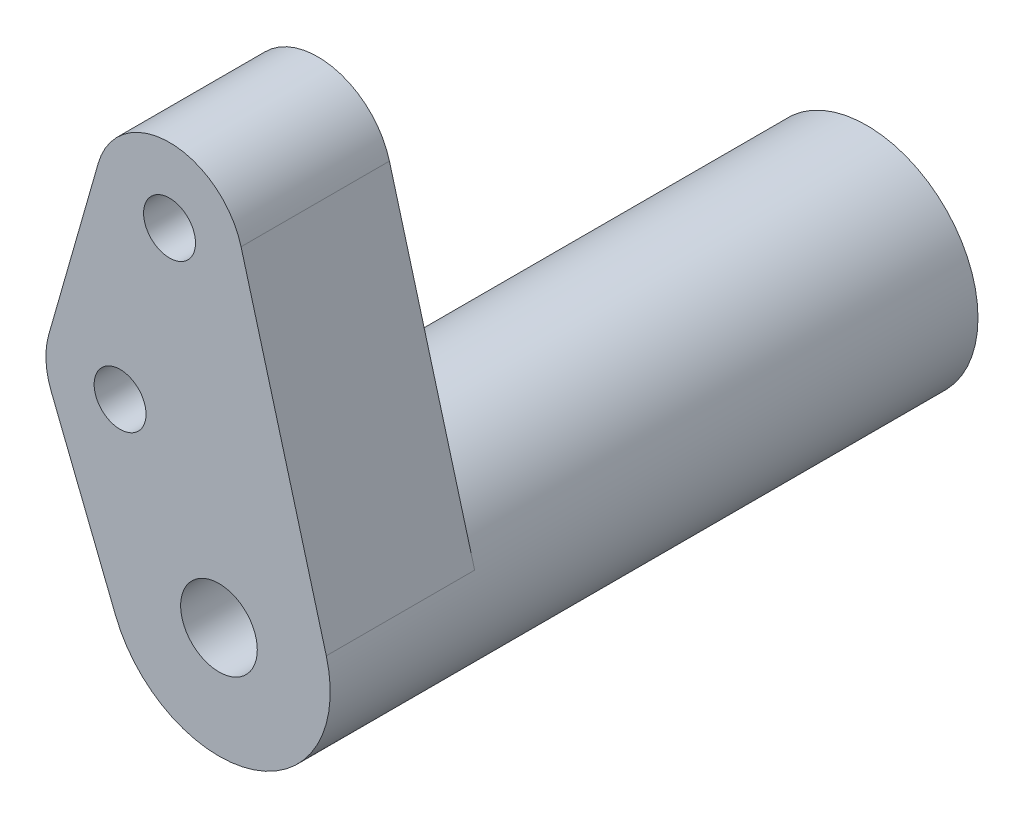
ISO-10303-21;
HEADER;
FILE_DESCRIPTION(('STEP AP214'),'2;1');
FILE_NAME('part.step','',(''),(''),'','','');
FILE_SCHEMA(('AUTOMOTIVE_DESIGN { 1 0 10303 214 1 1 1 1 }'));
ENDSEC;
DATA;
#1=APPLICATION_CONTEXT('core data for automotive mechanical design processes');
#2=APPLICATION_PROTOCOL_DEFINITION('international standard','automotive_design',2000,#1);
#3=PRODUCT_CONTEXT('',#1,'mechanical');
#4=PRODUCT('Part','Part','',(#3));
#5=PRODUCT_RELATED_PRODUCT_CATEGORY('part','',(#4));
#6=PRODUCT_DEFINITION_FORMATION('','',#4);
#7=PRODUCT_DEFINITION_CONTEXT('part definition',#1,'design');
#8=PRODUCT_DEFINITION('design','',#6,#7);
#9=PRODUCT_DEFINITION_SHAPE('','',#8);
#10=(LENGTH_UNIT() NAMED_UNIT(*) SI_UNIT(.MILLI.,.METRE.));
#11=(NAMED_UNIT(*) PLANE_ANGLE_UNIT() SI_UNIT($,.RADIAN.));
#12=(NAMED_UNIT(*) SI_UNIT($,.STERADIAN.) SOLID_ANGLE_UNIT());
#13=UNCERTAINTY_MEASURE_WITH_UNIT(LENGTH_MEASURE(1.E-05),#10,'distance_accuracy_value','');
#14=(GEOMETRIC_REPRESENTATION_CONTEXT(3) GLOBAL_UNCERTAINTY_ASSIGNED_CONTEXT((#13)) GLOBAL_UNIT_ASSIGNED_CONTEXT((#10,
#11,#12)) REPRESENTATION_CONTEXT('',''));
#15=CARTESIAN_POINT('',(0.,0.,0.));
#16=DIRECTION('',(0.,0.,1.));
#17=DIRECTION('',(1.,0.,0.));
#18=AXIS2_PLACEMENT_3D('',#15,#16,#17);
#19=CARTESIAN_POINT('',(-36.,-62.,14.));
#20=DIRECTION('',(0.,0.,1.));
#21=DIRECTION('',(1.,0.,0.));
#22=AXIS2_PLACEMENT_3D('',#19,#20,#21);
#23=PLANE('',#22);
#24=CARTESIAN_POINT('',(-36.,-62.,14.));
#25=DIRECTION('',(0.,0.,1.));
#26=DIRECTION('',(1.,0.,0.));
#27=AXIS2_PLACEMENT_3D('',#24,#25,#26);
#28=CIRCLE('',#27,9.);
#29=CARTESIAN_POINT('',(-27.,-62.,14.));
#30=VERTEX_POINT('',#29);
#31=EDGE_CURVE('E40',#30,#30,#28,.T.);
#32=ORIENTED_EDGE('',*,*,#31,.F.);
#33=EDGE_LOOP('',(#32));
#34=FACE_BOUND('',#33,.T.);
#35=CARTESIAN_POINT('',(-36.,-62.,14.));
#36=DIRECTION('',(0.,0.,1.));
#37=DIRECTION('',(1.,0.,0.));
#38=AXIS2_PLACEMENT_3D('',#35,#36,#37);
#39=CIRCLE('',#38,3.1);
#40=CARTESIAN_POINT('',(-32.9,-62.,14.));
#41=VERTEX_POINT('',#40);
#42=EDGE_CURVE('E142',#41,#41,#39,.T.);
#43=ORIENTED_EDGE('',*,*,#42,.T.);
#44=EDGE_LOOP('',(#43));
#45=FACE_BOUND('',#44,.T.);
#46=ADVANCED_FACE('F36',(#34,#45),#23,.F.);
#47=CARTESIAN_POINT('',(-36.,-62.,54.4));
#48=DIRECTION('',(0.,0.,-1.));
#49=DIRECTION('',(-1.,0.,0.));
#50=AXIS2_PLACEMENT_3D('',#47,#48,#49);
#51=CYLINDRICAL_SURFACE('',#50,9.);
#52=CARTESIAN_POINT('',(-36.,-62.,54.4));
#53=DIRECTION('',(0.,0.,1.));
#54=DIRECTION('',(1.,0.,0.));
#55=AXIS2_PLACEMENT_3D('',#52,#53,#54);
#56=CIRCLE('',#55,9.);
#57=CARTESIAN_POINT('',(-27.3187588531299,-59.6259629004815,54.4));
#58=VERTEX_POINT('',#57);
#59=CARTESIAN_POINT('',(-44.3631129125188,-65.3254086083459,54.4));
#60=VERTEX_POINT('',#59);
#61=EDGE_CURVE('E11',#58,#60,#56,.T.);
#62=ORIENTED_EDGE('',*,*,#61,.F.);
#63=DIRECTION('',(0.,0.,-1.));
#64=VECTOR('',#63,1.);
#65=CARTESIAN_POINT('',(-27.3187588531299,-59.6259629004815,66.4));
#66=LINE('',#65,#64);
#67=CARTESIAN_POINT('',(-27.3187588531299,-59.6259629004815,66.4));
#68=VERTEX_POINT('',#67);
#69=EDGE_CURVE('E114',#68,#58,#66,.T.);
#70=ORIENTED_EDGE('',*,*,#69,.F.);
#71=CARTESIAN_POINT('',(-36.,-62.,66.4));
#72=DIRECTION('',(0.,0.,1.));
#73=DIRECTION('',(1.,0.,0.));
#74=AXIS2_PLACEMENT_3D('',#71,#72,#73);
#75=CIRCLE('',#74,9.);
#76=CARTESIAN_POINT('',(-44.3631129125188,-65.3254086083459,66.4));
#77=VERTEX_POINT('',#76);
#78=EDGE_CURVE('E103',#77,#68,#75,.T.);
#79=ORIENTED_EDGE('',*,*,#78,.F.);
#80=DIRECTION('',(0.,0.,-1.));
#81=VECTOR('',#80,1.);
#82=CARTESIAN_POINT('',(-44.3631129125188,-65.3254086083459,66.4));
#83=LINE('',#82,#81);
#84=EDGE_CURVE('E137',#77,#60,#83,.T.);
#85=ORIENTED_EDGE('',*,*,#84,.T.);
#86=EDGE_LOOP('',(#62,#70,#79,#85));
#87=FACE_BOUND('',#86,.T.);
#88=ORIENTED_EDGE('',*,*,#31,.T.);
#89=EDGE_LOOP('',(#88));
#90=FACE_BOUND('',#89,.T.);
#91=ADVANCED_FACE('F38',(#87,#90),#51,.T.);
#92=CARTESIAN_POINT('',(-36.,-62.,54.4));
#93=DIRECTION('',(0.,0.,-1.));
#94=DIRECTION('',(-1.,0.,0.));
#95=AXIS2_PLACEMENT_3D('',#92,#93,#94);
#96=CYLINDRICAL_SURFACE('',#95,3.1);
#97=ORIENTED_EDGE('',*,*,#42,.F.);
#98=EDGE_LOOP('',(#97));
#99=FACE_BOUND('',#98,.T.);
#100=CARTESIAN_POINT('',(-36.,-62.,66.4));
#101=DIRECTION('',(0.,0.,1.));
#102=DIRECTION('',(1.,0.,0.));
#103=AXIS2_PLACEMENT_3D('',#100,#101,#102);
#104=CIRCLE('',#103,3.1);
#105=CARTESIAN_POINT('',(-32.9,-62.,66.4));
#106=VERTEX_POINT('',#105);
#107=EDGE_CURVE('E197',#106,#106,#104,.T.);
#108=ORIENTED_EDGE('',*,*,#107,.T.);
#109=EDGE_LOOP('',(#108));
#110=FACE_BOUND('',#109,.T.);
#111=ADVANCED_FACE('F154',(#99,#110),#96,.F.);
#112=CARTESIAN_POINT('',(-44.,-50.,54.4));
#113=DIRECTION('',(0.,0.,1.));
#114=DIRECTION('',(1.,0.,0.));
#115=AXIS2_PLACEMENT_3D('',#112,#113,#114);
#116=PLANE('',#115);
#117=CARTESIAN_POINT('',(-44.,-50.,54.4));
#118=DIRECTION('',(0.,0.,1.));
#119=DIRECTION('',(1.,0.,0.));
#120=AXIS2_PLACEMENT_3D('',#117,#118,#119);
#121=CIRCLE('',#120,2.09999999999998);
#122=CARTESIAN_POINT('',(-41.9,-50.,54.4));
#123=VERTEX_POINT('',#122);
#124=EDGE_CURVE('E196',#123,#123,#121,.T.);
#125=ORIENTED_EDGE('',*,*,#124,.T.);
#126=EDGE_LOOP('',(#125));
#127=FACE_BOUND('',#126,.T.);
#128=CARTESIAN_POINT('',(-40.,-36.,54.4));
#129=DIRECTION('',(0.,0.,1.));
#130=DIRECTION('',(1.,0.,0.));
#131=AXIS2_PLACEMENT_3D('',#128,#129,#130);
#132=CIRCLE('',#131,2.1);
#133=CARTESIAN_POINT('',(-37.9,-36.,54.4));
#134=VERTEX_POINT('',#133);
#135=EDGE_CURVE('E199',#134,#134,#132,.T.);
#136=ORIENTED_EDGE('',*,*,#135,.T.);
#137=EDGE_LOOP('',(#136));
#138=FACE_BOUND('',#137,.T.);
#139=DIRECTION('',(-0.263781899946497,0.96458234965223,0.));
#140=VECTOR('',#139,1.);
#141=CARTESIAN_POINT('',(-27.3187588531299,-59.6259629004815,54.4));
#142=LINE('',#141,#140);
#143=CARTESIAN_POINT('',(-34.2125059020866,-34.417308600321,54.4));
#144=VERTEX_POINT('',#143);
#145=EDGE_CURVE('E111',#58,#144,#142,.T.);
#146=ORIENTED_EDGE('',*,*,#145,.F.);
#147=ORIENTED_EDGE('',*,*,#61,.T.);
#148=DIRECTION('',(0.369489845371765,-0.929234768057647,0.));
#149=VECTOR('',#148,1.);
#150=CARTESIAN_POINT('',(-49.5754086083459,-52.2169390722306,54.4));
#151=LINE('',#150,#149);
#152=CARTESIAN_POINT('',(-49.5754086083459,-52.2169390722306,54.4));
#153=VERTEX_POINT('',#152);
#154=EDGE_CURVE('E126',#153,#60,#151,.T.);
#155=ORIENTED_EDGE('',*,*,#154,.F.);
#156=CARTESIAN_POINT('',(-44.,-50.,54.4));
#157=DIRECTION('',(0.,0.,1.));
#158=DIRECTION('',(1.,0.,0.));
#159=AXIS2_PLACEMENT_3D('',#156,#157,#158);
#160=CIRCLE('',#159,6.00000000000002);
#161=CARTESIAN_POINT('',(-49.7691436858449,-48.3516732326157,54.4));
#162=VERTEX_POINT('',#161);
#163=EDGE_CURVE('E123',#162,#153,#160,.T.);
#164=ORIENTED_EDGE('',*,*,#163,.F.);
#165=DIRECTION('',(-0.274721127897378,-0.961523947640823,0.));
#166=VECTOR('',#165,1.);
#167=CARTESIAN_POINT('',(-45.7691436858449,-34.3516732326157,54.4));
#168=LINE('',#167,#166);
#169=CARTESIAN_POINT('',(-45.7691436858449,-34.3516732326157,54.4));
#170=VERTEX_POINT('',#169);
#171=EDGE_CURVE('E79',#170,#162,#168,.T.);
#172=ORIENTED_EDGE('',*,*,#171,.F.);
#173=CARTESIAN_POINT('',(-40.,-36.,54.4));
#174=DIRECTION('',(0.,0.,1.));
#175=DIRECTION('',(1.,0.,0.));
#176=AXIS2_PLACEMENT_3D('',#173,#174,#175);
#177=CIRCLE('',#176,6.);
#178=EDGE_CURVE('E130',#144,#170,#177,.T.);
#179=ORIENTED_EDGE('',*,*,#178,.F.);
#180=EDGE_LOOP('',(#146,#147,#155,#164,#172,#179));
#181=FACE_BOUND('',#180,.T.);
#182=ADVANCED_FACE('F159',(#127,#138,#181),#116,.F.);
#183=CARTESIAN_POINT('',(-44.,-50.,66.4));
#184=DIRECTION('',(0.,0.,1.));
#185=DIRECTION('',(1.,0.,0.));
#186=AXIS2_PLACEMENT_3D('',#183,#184,#185);
#187=PLANE('',#186);
#188=CARTESIAN_POINT('',(-44.,-50.,66.4));
#189=DIRECTION('',(0.,0.,1.));
#190=DIRECTION('',(1.,0.,0.));
#191=AXIS2_PLACEMENT_3D('',#188,#189,#190);
#192=CIRCLE('',#191,2.09999999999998);
#193=CARTESIAN_POINT('',(-41.9,-50.,66.4));
#194=VERTEX_POINT('',#193);
#195=EDGE_CURVE('E193',#194,#194,#192,.T.);
#196=ORIENTED_EDGE('',*,*,#195,.F.);
#197=EDGE_LOOP('',(#196));
#198=FACE_BOUND('',#197,.T.);
#199=CARTESIAN_POINT('',(-44.,-50.,66.4));
#200=DIRECTION('',(0.,0.,1.));
#201=DIRECTION('',(1.,0.,0.));
#202=AXIS2_PLACEMENT_3D('',#199,#200,#201);
#203=CIRCLE('',#202,6.00000000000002);
#204=CARTESIAN_POINT('',(-49.7691436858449,-48.3516732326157,66.4));
#205=VERTEX_POINT('',#204);
#206=CARTESIAN_POINT('',(-49.5754086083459,-52.2169390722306,66.4));
#207=VERTEX_POINT('',#206);
#208=EDGE_CURVE('E133',#205,#207,#203,.T.);
#209=ORIENTED_EDGE('',*,*,#208,.T.);
#210=DIRECTION('',(0.369489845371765,-0.929234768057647,0.));
#211=VECTOR('',#210,1.);
#212=CARTESIAN_POINT('',(-49.5754086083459,-52.2169390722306,66.4));
#213=LINE('',#212,#211);
#214=EDGE_CURVE('E88',#207,#77,#213,.T.);
#215=ORIENTED_EDGE('',*,*,#214,.T.);
#216=ORIENTED_EDGE('',*,*,#78,.T.);
#217=DIRECTION('',(-0.263781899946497,0.96458234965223,0.));
#218=VECTOR('',#217,1.);
#219=CARTESIAN_POINT('',(-27.3187588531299,-59.6259629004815,66.4));
#220=LINE('',#219,#218);
#221=CARTESIAN_POINT('',(-34.2125059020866,-34.417308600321,66.4));
#222=VERTEX_POINT('',#221);
#223=EDGE_CURVE('E95',#68,#222,#220,.T.);
#224=ORIENTED_EDGE('',*,*,#223,.T.);
#225=CARTESIAN_POINT('',(-40.,-36.,66.4));
#226=DIRECTION('',(0.,0.,1.));
#227=DIRECTION('',(1.,0.,0.));
#228=AXIS2_PLACEMENT_3D('',#225,#226,#227);
#229=CIRCLE('',#228,6.);
#230=CARTESIAN_POINT('',(-45.7691436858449,-34.3516732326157,66.4));
#231=VERTEX_POINT('',#230);
#232=EDGE_CURVE('E100',#222,#231,#229,.T.);
#233=ORIENTED_EDGE('',*,*,#232,.T.);
#234=DIRECTION('',(-0.274721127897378,-0.961523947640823,0.));
#235=VECTOR('',#234,1.);
#236=CARTESIAN_POINT('',(-45.7691436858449,-34.3516732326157,66.4));
#237=LINE('',#236,#235);
#238=EDGE_CURVE('E58',#231,#205,#237,.T.);
#239=ORIENTED_EDGE('',*,*,#238,.T.);
#240=EDGE_LOOP('',(#209,#215,#216,#224,#233,#239));
#241=FACE_BOUND('',#240,.T.);
#242=CARTESIAN_POINT('',(-40.,-36.,66.4));
#243=DIRECTION('',(0.,0.,1.));
#244=DIRECTION('',(1.,0.,0.));
#245=AXIS2_PLACEMENT_3D('',#242,#243,#244);
#246=CIRCLE('',#245,2.1);
#247=CARTESIAN_POINT('',(-37.9,-36.,66.4));
#248=VERTEX_POINT('',#247);
#249=EDGE_CURVE('E127',#248,#248,#246,.T.);
#250=ORIENTED_EDGE('',*,*,#249,.F.);
#251=EDGE_LOOP('',(#250));
#252=FACE_BOUND('',#251,.T.);
#253=ORIENTED_EDGE('',*,*,#107,.F.);
#254=EDGE_LOOP('',(#253));
#255=FACE_BOUND('',#254,.T.);
#256=ADVANCED_FACE('F97',(#198,#241,#252,#255),#187,.T.);
#257=CARTESIAN_POINT('',(-44.,-50.,66.4));
#258=DIRECTION('',(0.,0.,-1.));
#259=DIRECTION('',(-1.,0.,0.));
#260=AXIS2_PLACEMENT_3D('',#257,#258,#259);
#261=CYLINDRICAL_SURFACE('',#260,6.00000000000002);
#262=ORIENTED_EDGE('',*,*,#163,.T.);
#263=DIRECTION('',(0.,0.,-1.));
#264=VECTOR('',#263,1.);
#265=CARTESIAN_POINT('',(-49.5754086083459,-52.2169390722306,66.4));
#266=LINE('',#265,#264);
#267=EDGE_CURVE('E140',#207,#153,#266,.T.);
#268=ORIENTED_EDGE('',*,*,#267,.F.);
#269=ORIENTED_EDGE('',*,*,#208,.F.);
#270=DIRECTION('',(0.,0.,-1.));
#271=VECTOR('',#270,1.);
#272=CARTESIAN_POINT('',(-49.7691436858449,-48.3516732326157,66.4));
#273=LINE('',#272,#271);
#274=EDGE_CURVE('E119',#205,#162,#273,.T.);
#275=ORIENTED_EDGE('',*,*,#274,.T.);
#276=EDGE_LOOP('',(#262,#268,#269,#275));
#277=FACE_BOUND('',#276,.T.);
#278=ADVANCED_FACE('F161',(#277),#261,.T.);
#279=CARTESIAN_POINT('',(-49.5754086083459,-52.2169390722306,66.4));
#280=DIRECTION('',(0.929234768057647,0.369489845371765,0.));
#281=DIRECTION('',(-0.369489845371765,0.929234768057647,0.));
#282=AXIS2_PLACEMENT_3D('',#279,#280,#281);
#283=PLANE('',#282);
#284=ORIENTED_EDGE('',*,*,#154,.T.);
#285=ORIENTED_EDGE('',*,*,#84,.F.);
#286=ORIENTED_EDGE('',*,*,#214,.F.);
#287=ORIENTED_EDGE('',*,*,#267,.T.);
#288=EDGE_LOOP('',(#284,#285,#286,#287));
#289=FACE_BOUND('',#288,.T.);
#290=ADVANCED_FACE('F164',(#289),#283,.F.);
#291=CARTESIAN_POINT('',(-27.3187588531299,-59.6259629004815,66.4));
#292=DIRECTION('',(-0.96458234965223,-0.263781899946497,0.));
#293=DIRECTION('',(0.263781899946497,-0.96458234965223,0.));
#294=AXIS2_PLACEMENT_3D('',#291,#292,#293);
#295=PLANE('',#294);
#296=ORIENTED_EDGE('',*,*,#145,.T.);
#297=DIRECTION('',(0.,0.,-1.));
#298=VECTOR('',#297,1.);
#299=CARTESIAN_POINT('',(-34.2125059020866,-34.417308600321,66.4));
#300=LINE('',#299,#298);
#301=EDGE_CURVE('E109',#222,#144,#300,.T.);
#302=ORIENTED_EDGE('',*,*,#301,.F.);
#303=ORIENTED_EDGE('',*,*,#223,.F.);
#304=ORIENTED_EDGE('',*,*,#69,.T.);
#305=EDGE_LOOP('',(#296,#302,#303,#304));
#306=FACE_BOUND('',#305,.T.);
#307=ADVANCED_FACE('F110',(#306),#295,.F.);
#308=CARTESIAN_POINT('',(-40.,-36.,66.4));
#309=DIRECTION('',(0.,0.,-1.));
#310=DIRECTION('',(-1.,0.,0.));
#311=AXIS2_PLACEMENT_3D('',#308,#309,#310);
#312=CYLINDRICAL_SURFACE('',#311,6.);
#313=ORIENTED_EDGE('',*,*,#178,.T.);
#314=DIRECTION('',(0.,0.,-1.));
#315=VECTOR('',#314,1.);
#316=CARTESIAN_POINT('',(-45.7691436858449,-34.3516732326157,66.4));
#317=LINE('',#316,#315);
#318=EDGE_CURVE('E115',#231,#170,#317,.T.);
#319=ORIENTED_EDGE('',*,*,#318,.F.);
#320=ORIENTED_EDGE('',*,*,#232,.F.);
#321=ORIENTED_EDGE('',*,*,#301,.T.);
#322=EDGE_LOOP('',(#313,#319,#320,#321));
#323=FACE_BOUND('',#322,.T.);
#324=ADVANCED_FACE('F117',(#323),#312,.T.);
#325=CARTESIAN_POINT('',(-45.7691436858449,-34.3516732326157,66.4));
#326=DIRECTION('',(0.961523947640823,-0.274721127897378,0.));
#327=DIRECTION('',(0.274721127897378,0.961523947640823,0.));
#328=AXIS2_PLACEMENT_3D('',#325,#326,#327);
#329=PLANE('',#328);
#330=ORIENTED_EDGE('',*,*,#171,.T.);
#331=ORIENTED_EDGE('',*,*,#274,.F.);
#332=ORIENTED_EDGE('',*,*,#238,.F.);
#333=ORIENTED_EDGE('',*,*,#318,.T.);
#334=EDGE_LOOP('',(#330,#331,#332,#333));
#335=FACE_BOUND('',#334,.T.);
#336=ADVANCED_FACE('F172',(#335),#329,.F.);
#337=CARTESIAN_POINT('',(-40.,-36.,66.4));
#338=DIRECTION('',(0.,0.,-1.));
#339=DIRECTION('',(-1.,0.,0.));
#340=AXIS2_PLACEMENT_3D('',#337,#338,#339);
#341=CYLINDRICAL_SURFACE('',#340,2.1);
#342=ORIENTED_EDGE('',*,*,#249,.T.);
#343=EDGE_LOOP('',(#342));
#344=FACE_BOUND('',#343,.T.);
#345=ORIENTED_EDGE('',*,*,#135,.F.);
#346=EDGE_LOOP('',(#345));
#347=FACE_BOUND('',#346,.T.);
#348=ADVANCED_FACE('F175',(#344,#347),#341,.F.);
#349=CARTESIAN_POINT('',(-44.,-50.,66.4));
#350=DIRECTION('',(0.,0.,-1.));
#351=DIRECTION('',(-1.,0.,0.));
#352=AXIS2_PLACEMENT_3D('',#349,#350,#351);
#353=CYLINDRICAL_SURFACE('',#352,2.09999999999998);
#354=ORIENTED_EDGE('',*,*,#195,.T.);
#355=EDGE_LOOP('',(#354));
#356=FACE_BOUND('',#355,.T.);
#357=ORIENTED_EDGE('',*,*,#124,.F.);
#358=EDGE_LOOP('',(#357));
#359=FACE_BOUND('',#358,.T.);
#360=ADVANCED_FACE('F184',(#356,#359),#353,.F.);
#361=CLOSED_SHELL('',(#46,#91,#111,#182,#256,#278,#290,#307,#324,#336,#348,#360));
#362=MANIFOLD_SOLID_BREP('B2',#361);
#363=ADVANCED_BREP_SHAPE_REPRESENTATION('',(#18,#362),#14);
#364=SHAPE_DEFINITION_REPRESENTATION(#9,#363);
ENDSEC;
END-ISO-10303-21;
